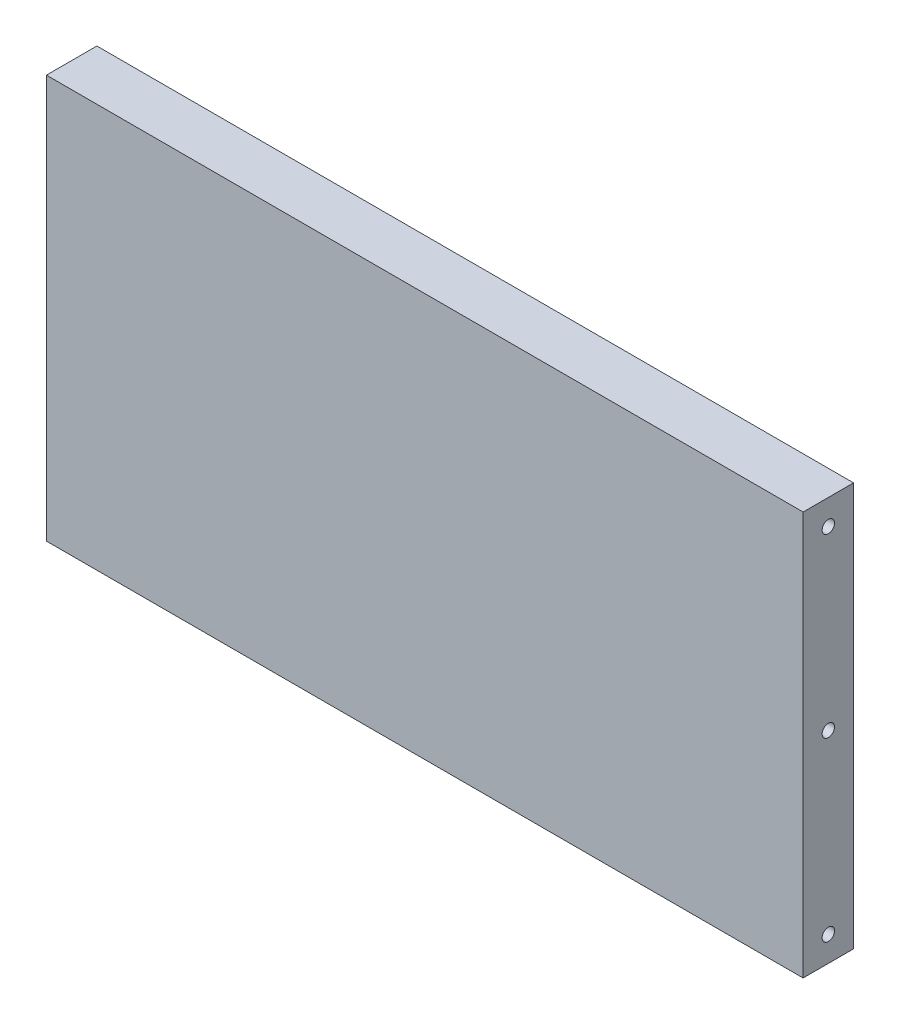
from build123d import *

# Parameters (mm, degrees)
SKIZZE1_W                       = 150
SKIZZE1_H                       = 80
AUFSATZ_LINEAR_AUSTRAGEN1_DEPTH = 10
SKIZZE2_R                       = 1.23
SCHNITT_LINEAR_AUSTRAGEN1_DEPTH = 5
SCHNITT_LINEAR_START            = -5
SKIZZE3_R                       = 1.23
SCHNITT_LINEAR_AUSTRAGEN2_DEPTH = 5


with BuildPart() as part:
    # Skizze1 → Aufsatz-Linear austragen1 (new body)
    with BuildSketch(Plane.XY):
        with Locations((9.444388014, 25.227272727)):
            Rectangle(SKIZZE1_W, SKIZZE1_H)
    extrude(amount=AUFSATZ_LINEAR_AUSTRAGEN1_DEPTH)

    # Skizze2 → Schnitt-Linear austragen1 (cut)
    with BuildSketch(Plane.ZY.offset(65.555611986)):
        with Locations(Location((5, 60.227272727, 0), (0, 0, 270))):
            Circle(SKIZZE2_R)
        with Locations(Location((5, 25.227272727, 0), (0, 0, 270))):
            Circle(SKIZZE2_R)
        with Locations(Location((5, -9.772727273, 0), (0, 0, 270))):
            Circle(SKIZZE2_R)
    extrude(amount=-SCHNITT_LINEAR_AUSTRAGEN1_DEPTH, mode=Mode.SUBTRACT)

    # Skizze3 → Schnitt-Linear austragen2 (cut)
    with BuildSketch(Plane(origin=(84.444388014, 0, 0), x_dir=(0, 0, -1), z_dir=(1, 0, 0)).offset(SCHNITT_LINEAR_START)):
        with Locations(Location((-5, 60.227272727, 0), (0, 0, 270))):
            Circle(SKIZZE3_R)
        with Locations(Location((-5, 25.227272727, 0), (0, 0, 270))):
            Circle(SKIZZE3_R)
        with Locations(Location((-5, -9.772727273, 0), (0, 0, 270))):
            Circle(SKIZZE3_R)
    extrude(amount=SCHNITT_LINEAR_AUSTRAGEN2_DEPTH, mode=Mode.SUBTRACT)


solid = part.part
